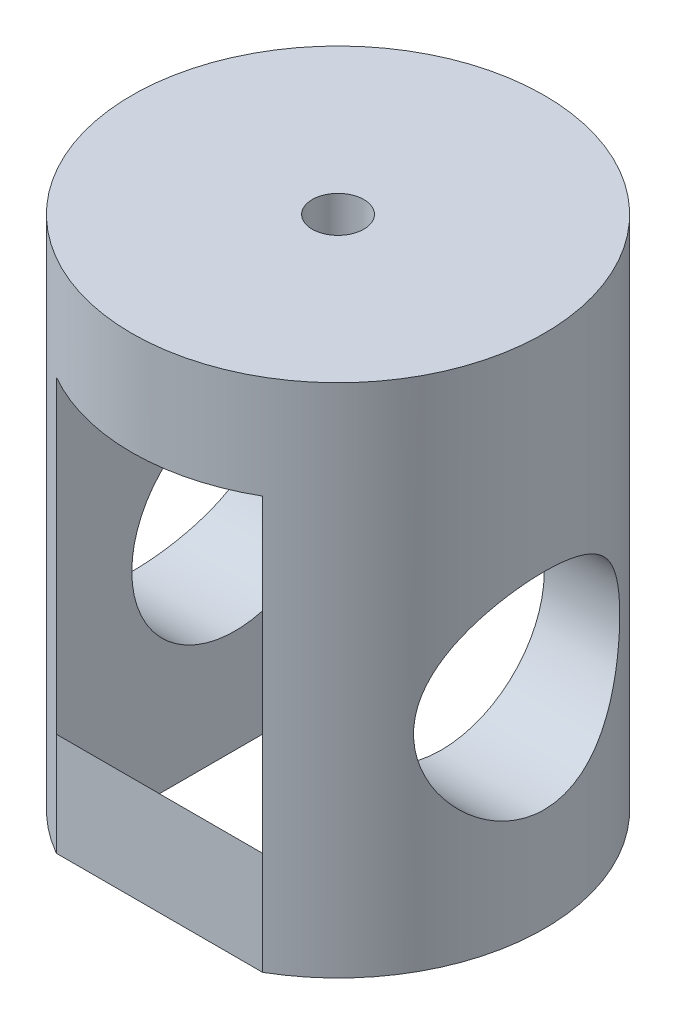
ISO-10303-21;
HEADER;
FILE_DESCRIPTION(('STEP AP214'),'2;1');
FILE_NAME('part.step','',(''),(''),'','','');
FILE_SCHEMA(('AUTOMOTIVE_DESIGN { 1 0 10303 214 1 1 1 1 }'));
ENDSEC;
DATA;
#1=APPLICATION_CONTEXT('core data for automotive mechanical design processes');
#2=APPLICATION_PROTOCOL_DEFINITION('international standard','automotive_design',2000,#1);
#3=PRODUCT_CONTEXT('',#1,'mechanical');
#4=PRODUCT('Part','Part','',(#3));
#5=PRODUCT_RELATED_PRODUCT_CATEGORY('part','',(#4));
#6=PRODUCT_DEFINITION_FORMATION('','',#4);
#7=PRODUCT_DEFINITION_CONTEXT('part definition',#1,'design');
#8=PRODUCT_DEFINITION('design','',#6,#7);
#9=PRODUCT_DEFINITION_SHAPE('','',#8);
#10=(LENGTH_UNIT() NAMED_UNIT(*) SI_UNIT(.MILLI.,.METRE.));
#11=(NAMED_UNIT(*) PLANE_ANGLE_UNIT() SI_UNIT($,.RADIAN.));
#12=(NAMED_UNIT(*) SI_UNIT($,.STERADIAN.) SOLID_ANGLE_UNIT());
#13=UNCERTAINTY_MEASURE_WITH_UNIT(LENGTH_MEASURE(1.E-05),#10,'distance_accuracy_value','');
#14=(GEOMETRIC_REPRESENTATION_CONTEXT(3) GLOBAL_UNCERTAINTY_ASSIGNED_CONTEXT((#13)) GLOBAL_UNIT_ASSIGNED_CONTEXT((#10,
#11,#12)) REPRESENTATION_CONTEXT('',''));
#15=CARTESIAN_POINT('',(0.,0.,0.));
#16=DIRECTION('',(0.,0.,1.));
#17=DIRECTION('',(1.,0.,0.));
#18=AXIS2_PLACEMENT_3D('',#15,#16,#17);
#19=CARTESIAN_POINT('',(-10.,40.,-17.3205080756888));
#20=DIRECTION('',(-1.,0.,0.));
#21=DIRECTION('',(0.,0.,1.));
#22=AXIS2_PLACEMENT_3D('',#19,#20,#21);
#23=PLANE('',#22);
#24=CARTESIAN_POINT('',(-9.99999999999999,20.,0.));
#25=DIRECTION('',(-1.,0.,0.));
#26=DIRECTION('',(0.,0.,1.));
#27=AXIS2_PLACEMENT_3D('',#24,#25,#26);
#28=CIRCLE('',#27,10.);
#29=CARTESIAN_POINT('',(-9.99999999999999,20.,10.));
#30=VERTEX_POINT('',#29);
#31=EDGE_CURVE('E127',#30,#30,#28,.F.);
#32=ORIENTED_EDGE('',*,*,#31,.F.);
#33=EDGE_LOOP('',(#32));
#34=FACE_BOUND('',#33,.T.);
#35=DIRECTION('',(0.,-1.,0.));
#36=VECTOR('',#35,1.);
#37=CARTESIAN_POINT('',(-10.,0.,10.3205080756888));
#38=LINE('',#37,#36);
#39=CARTESIAN_POINT('',(-10.,2.86853441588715,10.3205080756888));
#40=VERTEX_POINT('',#39);
#41=CARTESIAN_POINT('',(-10.,0.,10.3205080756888));
#42=VERTEX_POINT('',#41);
#43=EDGE_CURVE('E117',#40,#42,#38,.T.);
#44=ORIENTED_EDGE('',*,*,#43,.T.);
#45=DIRECTION('',(0.,0.,-1.));
#46=VECTOR('',#45,1.);
#47=CARTESIAN_POINT('',(-10.,0.,-17.3205080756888));
#48=LINE('',#47,#46);
#49=CARTESIAN_POINT('',(-10.,0.,-17.3205080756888));
#50=VERTEX_POINT('',#49);
#51=EDGE_CURVE('E105',#42,#50,#48,.T.);
#52=ORIENTED_EDGE('',*,*,#51,.T.);
#53=DIRECTION('',(0.,-1.,0.));
#54=VECTOR('',#53,1.);
#55=CARTESIAN_POINT('',(-10.,40.,-17.3205080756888));
#56=LINE('',#55,#54);
#57=CARTESIAN_POINT('',(-10.,40.,-17.3205080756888));
#58=VERTEX_POINT('',#57);
#59=EDGE_CURVE('E53',#58,#50,#56,.T.);
#60=ORIENTED_EDGE('',*,*,#59,.F.);
#61=DIRECTION('',(0.,0.,-1.));
#62=VECTOR('',#61,1.);
#63=CARTESIAN_POINT('',(-10.,40.,-17.3205080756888));
#64=LINE('',#63,#62);
#65=CARTESIAN_POINT('',(-10.,40.,17.3205080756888));
#66=VERTEX_POINT('',#65);
#67=EDGE_CURVE('E114',#66,#58,#64,.T.);
#68=ORIENTED_EDGE('',*,*,#67,.F.);
#69=DIRECTION('',(0.,-1.,0.));
#70=VECTOR('',#69,1.);
#71=CARTESIAN_POINT('',(-10.,40.,17.3205080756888));
#72=LINE('',#71,#70);
#73=CARTESIAN_POINT('',(-10.,10.,17.3205080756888));
#74=VERTEX_POINT('',#73);
#75=EDGE_CURVE('E11',#66,#74,#72,.T.);
#76=ORIENTED_EDGE('',*,*,#75,.T.);
#77=CARTESIAN_POINT('',(-10.,20.,0.));
#78=DIRECTION('',(1.,0.,0.));
#79=DIRECTION('',(0.,0.,1.));
#80=AXIS2_PLACEMENT_3D('',#77,#78,#79);
#81=CIRCLE('',#80,20.);
#82=EDGE_CURVE('E59',#74,#40,#81,.T.);
#83=ORIENTED_EDGE('',*,*,#82,.T.);
#84=EDGE_LOOP('',(#44,#52,#60,#68,#76,#83));
#85=FACE_BOUND('',#84,.T.);
#86=ADVANCED_FACE('F43',(#34,#85),#23,.F.);
#87=CARTESIAN_POINT('',(10.,40.,-17.3205080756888));
#88=DIRECTION('',(1.,0.,0.));
#89=DIRECTION('',(0.,0.,-1.));
#90=AXIS2_PLACEMENT_3D('',#87,#88,#89);
#91=PLANE('',#90);
#92=CARTESIAN_POINT('',(10.,20.,0.));
#93=DIRECTION('',(1.,0.,0.));
#94=DIRECTION('',(0.,0.,-1.));
#95=AXIS2_PLACEMENT_3D('',#92,#93,#94);
#96=CIRCLE('',#95,10.);
#97=CARTESIAN_POINT('',(10.,20.,-10.));
#98=VERTEX_POINT('',#97);
#99=EDGE_CURVE('E48',#98,#98,#96,.F.);
#100=ORIENTED_EDGE('',*,*,#99,.F.);
#101=EDGE_LOOP('',(#100));
#102=FACE_BOUND('',#101,.T.);
#103=DIRECTION('',(0.,-1.,0.));
#104=VECTOR('',#103,1.);
#105=CARTESIAN_POINT('',(10.,0.,10.3205080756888));
#106=LINE('',#105,#104);
#107=CARTESIAN_POINT('',(10.,2.86853441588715,10.3205080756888));
#108=VERTEX_POINT('',#107);
#109=CARTESIAN_POINT('',(10.,0.,10.3205080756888));
#110=VERTEX_POINT('',#109);
#111=EDGE_CURVE('E123',#108,#110,#106,.T.);
#112=ORIENTED_EDGE('',*,*,#111,.F.);
#113=CARTESIAN_POINT('',(10.,20.,0.));
#114=DIRECTION('',(1.,0.,0.));
#115=DIRECTION('',(0.,0.,1.));
#116=AXIS2_PLACEMENT_3D('',#113,#114,#115);
#117=CIRCLE('',#116,20.);
#118=CARTESIAN_POINT('',(10.,10.,17.3205080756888));
#119=VERTEX_POINT('',#118);
#120=EDGE_CURVE('E120',#119,#108,#117,.T.);
#121=ORIENTED_EDGE('',*,*,#120,.F.);
#122=DIRECTION('',(0.,-1.,0.));
#123=VECTOR('',#122,1.);
#124=CARTESIAN_POINT('',(10.,40.,17.3205080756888));
#125=LINE('',#124,#123);
#126=CARTESIAN_POINT('',(10.,40.,17.3205080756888));
#127=VERTEX_POINT('',#126);
#128=EDGE_CURVE('E197',#127,#119,#125,.T.);
#129=ORIENTED_EDGE('',*,*,#128,.F.);
#130=DIRECTION('',(0.,0.,1.));
#131=VECTOR('',#130,1.);
#132=CARTESIAN_POINT('',(10.,40.,-17.3205080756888));
#133=LINE('',#132,#131);
#134=CARTESIAN_POINT('',(10.,40.,-17.3205080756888));
#135=VERTEX_POINT('',#134);
#136=EDGE_CURVE('E194',#135,#127,#133,.T.);
#137=ORIENTED_EDGE('',*,*,#136,.F.);
#138=DIRECTION('',(0.,-1.,0.));
#139=VECTOR('',#138,1.);
#140=CARTESIAN_POINT('',(10.,40.,-17.3205080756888));
#141=LINE('',#140,#139);
#142=CARTESIAN_POINT('',(10.,0.,-17.3205080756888));
#143=VERTEX_POINT('',#142);
#144=EDGE_CURVE('E200',#135,#143,#141,.T.);
#145=ORIENTED_EDGE('',*,*,#144,.T.);
#146=DIRECTION('',(0.,0.,1.));
#147=VECTOR('',#146,1.);
#148=CARTESIAN_POINT('',(10.,0.,-17.3205080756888));
#149=LINE('',#148,#147);
#150=EDGE_CURVE('E190',#143,#110,#149,.T.);
#151=ORIENTED_EDGE('',*,*,#150,.T.);
#152=EDGE_LOOP('',(#112,#121,#129,#137,#145,#151));
#153=FACE_BOUND('',#152,.T.);
#154=ADVANCED_FACE('F156',(#102,#153),#91,.F.);
#155=CARTESIAN_POINT('',(0.,40.,0.));
#156=DIRECTION('',(0.,-1.,0.));
#157=DIRECTION('',(0.,0.,-1.));
#158=AXIS2_PLACEMENT_3D('',#155,#156,#157);
#159=CYLINDRICAL_SURFACE('',#158,20.);
#160=CARTESIAN_POINT('',(0.,0.,0.));
#161=DIRECTION('',(0.,1.,0.));
#162=DIRECTION('',(0.,0.,1.));
#163=AXIS2_PLACEMENT_3D('',#160,#161,#162);
#164=CIRCLE('',#163,20.);
#165=CARTESIAN_POINT('',(-10.,0.,17.3205080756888));
#166=VERTEX_POINT('',#165);
#167=EDGE_CURVE('E111',#50,#166,#164,.T.);
#168=ORIENTED_EDGE('',*,*,#167,.T.);
#169=DIRECTION('',(0.,1.,0.));
#170=VECTOR('',#169,1.);
#171=CARTESIAN_POINT('',(-10.,0.,17.3205080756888));
#172=LINE('',#171,#170);
#173=EDGE_CURVE('E67',#166,#74,#172,.T.);
#174=ORIENTED_EDGE('',*,*,#173,.T.);
#175=ORIENTED_EDGE('',*,*,#75,.F.);
#176=CARTESIAN_POINT('',(0.,40.,0.));
#177=DIRECTION('',(0.,1.,0.));
#178=DIRECTION('',(0.,0.,1.));
#179=AXIS2_PLACEMENT_3D('',#176,#177,#178);
#180=CIRCLE('',#179,20.);
#181=EDGE_CURVE('E213',#66,#127,#180,.T.);
#182=ORIENTED_EDGE('',*,*,#181,.T.);
#183=ORIENTED_EDGE('',*,*,#128,.T.);
#184=DIRECTION('',(0.,1.,0.));
#185=VECTOR('',#184,1.);
#186=CARTESIAN_POINT('',(10.,0.,17.3205080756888));
#187=LINE('',#186,#185);
#188=CARTESIAN_POINT('',(10.,0.,17.3205080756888));
#189=VERTEX_POINT('',#188);
#190=EDGE_CURVE('E229',#189,#119,#187,.T.);
#191=ORIENTED_EDGE('',*,*,#190,.F.);
#192=CARTESIAN_POINT('',(0.,0.,0.));
#193=DIRECTION('',(0.,1.,0.));
#194=DIRECTION('',(0.,0.,1.));
#195=AXIS2_PLACEMENT_3D('',#192,#193,#194);
#196=CIRCLE('',#195,20.);
#197=EDGE_CURVE('E188',#189,#143,#196,.T.);
#198=ORIENTED_EDGE('',*,*,#197,.T.);
#199=ORIENTED_EDGE('',*,*,#144,.F.);
#200=EDGE_CURVE('E207',#135,#58,#180,.T.);
#201=ORIENTED_EDGE('',*,*,#200,.T.);
#202=ORIENTED_EDGE('',*,*,#59,.T.);
#203=EDGE_LOOP('',(#168,#174,#175,#182,#183,#191,#198,#199,#201,#202));
#204=FACE_BOUND('',#203,.T.);
#205=CARTESIAN_POINT('',(0.,50.,0.));
#206=DIRECTION('',(0.,1.,0.));
#207=DIRECTION('',(0.,0.,1.));
#208=AXIS2_PLACEMENT_3D('',#205,#206,#207);
#209=CIRCLE('',#208,20.);
#210=CARTESIAN_POINT('',(0.,50.,20.));
#211=VERTEX_POINT('',#210);
#212=EDGE_CURVE('E210',#211,#211,#209,.T.);
#213=ORIENTED_EDGE('',*,*,#212,.F.);
#214=EDGE_LOOP('',(#213));
#215=FACE_BOUND('',#214,.T.);
#216=CARTESIAN_POINT('',(-17.3205080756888,20.,10.));
#217=CARTESIAN_POINT('',(-17.3205095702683,20.2606630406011,9.99999887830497));
#218=CARTESIAN_POINT('',(-17.3264124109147,20.5213487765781,9.98979463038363));
#219=CARTESIAN_POINT('',(-17.3498046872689,21.0407114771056,9.94911125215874));
#220=CARTESIAN_POINT('',(-17.3672995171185,21.2993874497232,9.91862268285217));
#221=CARTESIAN_POINT('',(-17.4132568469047,21.8130233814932,9.83771551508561));
#222=CARTESIAN_POINT('',(-17.4417365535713,22.0679768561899,9.78726564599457));
#223=CARTESIAN_POINT('',(-17.5086546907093,22.5720498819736,9.66704369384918));
#224=CARTESIAN_POINT('',(-17.5470974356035,22.821166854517,9.59726323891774));
#225=CARTESIAN_POINT('',(-17.6323996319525,23.310473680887,9.43962165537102));
#226=CARTESIAN_POINT('',(-17.6792090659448,23.5507068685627,9.3518675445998));
#227=CARTESIAN_POINT('',(-17.779982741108,24.0225542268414,9.15882440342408));
#228=CARTESIAN_POINT('',(-17.8339495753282,24.2541652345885,9.05352901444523));
#229=CARTESIAN_POINT('',(-17.9475017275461,24.7075453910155,8.82628481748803));
#230=CARTESIAN_POINT('',(-18.007085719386,24.9293168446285,8.70433993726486));
#231=CARTESIAN_POINT('',(-18.1303531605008,25.3621596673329,8.44458163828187));
#232=CARTESIAN_POINT('',(-18.1940367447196,25.5732306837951,8.30676769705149));
#233=CARTESIAN_POINT('',(-18.329363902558,26.0008375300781,8.0040071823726));
#234=CARTESIAN_POINT('',(-18.4012302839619,26.2163824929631,7.83775940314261));
#235=CARTESIAN_POINT('',(-18.5460965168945,26.6329349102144,7.48852658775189));
#236=CARTESIAN_POINT('',(-18.6190960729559,26.8339460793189,7.30554585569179));
#237=CARTESIAN_POINT('',(-18.7644955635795,27.2206945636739,6.92354675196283));
#238=CARTESIAN_POINT('',(-18.836894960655,27.4064192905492,6.72451542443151));
#239=CARTESIAN_POINT('',(-18.9792540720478,27.7613467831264,6.31154503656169));
#240=CARTESIAN_POINT('',(-19.0492146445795,27.9305553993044,6.09761130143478));
#241=CARTESIAN_POINT('',(-19.1896470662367,28.2623641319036,5.64077435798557));
#242=CARTESIAN_POINT('',(-19.2598322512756,28.4237392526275,5.39689043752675));
#243=CARTESIAN_POINT('',(-19.3935808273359,28.7252065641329,4.89454568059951));
#244=CARTESIAN_POINT('',(-19.4571438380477,28.8652975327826,4.63608400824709));
#245=CARTESIAN_POINT('',(-19.5757886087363,29.1227489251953,4.10635184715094));
#246=CARTESIAN_POINT('',(-19.6308744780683,29.240120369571,3.83508764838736));
#247=CARTESIAN_POINT('',(-19.7309453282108,29.4508629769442,3.28159286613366));
#248=CARTESIAN_POINT('',(-19.775931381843,29.5442366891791,2.99936345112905));
#249=CARTESIAN_POINT('',(-19.8516061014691,29.7000287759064,2.44661617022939));
#250=CARTESIAN_POINT('',(-19.8830841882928,29.7641767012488,2.17669338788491));
#251=CARTESIAN_POINT('',(-19.9352303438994,29.8699306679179,1.6314331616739));
#252=CARTESIAN_POINT('',(-19.9558988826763,29.9115376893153,1.35609595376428));
#253=CARTESIAN_POINT('',(-19.9858180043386,29.9716398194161,0.802434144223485));
#254=CARTESIAN_POINT('',(-19.9950744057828,29.9901467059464,0.52411113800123));
#255=CARTESIAN_POINT('',(-20.001913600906,30.003828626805,-0.0332441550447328));
#256=CARTESIAN_POINT('',(-19.9994971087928,29.9990050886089,-0.312276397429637));
#257=CARTESIAN_POINT('',(-19.9837839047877,29.9675360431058,-0.844365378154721));
#258=CARTESIAN_POINT('',(-19.9714530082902,29.9428274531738,-1.09756809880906));
#259=CARTESIAN_POINT('',(-19.9374335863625,29.8743173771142,-1.60072224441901));
#260=CARTESIAN_POINT('',(-19.9157457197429,29.8305172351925,-1.85067389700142));
#261=CARTESIAN_POINT('',(-19.8635314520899,29.724300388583,-2.34564683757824));
#262=CARTESIAN_POINT('',(-19.8330047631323,29.6618830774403,-2.59066796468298));
#263=CARTESIAN_POINT('',(-19.7638249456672,29.5190690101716,-3.0742307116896));
#264=CARTESIAN_POINT('',(-19.7251715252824,29.4386716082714,-3.31277209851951));
#265=CARTESIAN_POINT('',(-19.6400278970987,29.2594279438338,-3.78519130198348));
#266=CARTESIAN_POINT('',(-19.5934383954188,29.1603459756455,-4.01896179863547));
#267=CARTESIAN_POINT('',(-19.4938328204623,28.9453098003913,-4.47722728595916));
#268=CARTESIAN_POINT('',(-19.4408144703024,28.8293496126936,-4.70171895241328));
#269=CARTESIAN_POINT('',(-19.2738101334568,28.4574852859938,-5.35951935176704));
#270=CARTESIAN_POINT('',(-19.1518214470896,28.17748838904,-5.77743819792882));
#271=CARTESIAN_POINT('',(-18.8844067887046,27.5309599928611,-6.6018551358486));
#272=CARTESIAN_POINT('',(-18.7378553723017,27.1587504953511,-7.00353936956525));
#273=CARTESIAN_POINT('',(-18.5185765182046,26.5553615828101,-7.5565805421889));
#274=CARTESIAN_POINT('',(-18.4455210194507,26.3465480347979,-7.73279224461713));
#275=CARTESIAN_POINT('',(-18.301419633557,25.9146773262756,-8.06791510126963));
#276=CARTESIAN_POINT('',(-18.2303740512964,25.6916180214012,-8.22682364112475));
#277=CARTESIAN_POINT('',(-18.0878347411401,25.2176662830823,-8.5358678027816));
#278=CARTESIAN_POINT('',(-18.0166021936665,24.9659060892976,-8.68479491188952));
#279=CARTESIAN_POINT('',(-17.8810231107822,24.4489493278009,-8.96061518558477));
#280=CARTESIAN_POINT('',(-17.8166734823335,24.1837588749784,-9.08751826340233));
#281=CARTESIAN_POINT('',(-17.6972138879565,23.64159710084,-9.31801905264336));
#282=CARTESIAN_POINT('',(-17.6420984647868,23.3646328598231,-9.42163054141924));
#283=CARTESIAN_POINT('',(-17.5432965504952,22.8007562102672,-9.60435110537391));
#284=CARTESIAN_POINT('',(-17.4996085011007,22.5138451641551,-9.68346352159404));
#285=CARTESIAN_POINT('',(-17.4285246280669,21.9554952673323,-9.81078056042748));
#286=CARTESIAN_POINT('',(-17.400112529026,21.6846306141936,-9.86093677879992));
#287=CARTESIAN_POINT('',(-17.3557653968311,21.1386742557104,-9.93878416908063));
#288=CARTESIAN_POINT('',(-17.3398296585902,20.8635827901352,-9.96647661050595));
#289=CARTESIAN_POINT('',(-17.3211203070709,20.3117693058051,-9.99895720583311));
#290=CARTESIAN_POINT('',(-17.3183387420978,20.035048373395,-10.0037591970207));
#291=CARTESIAN_POINT('',(-17.3260388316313,19.4823571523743,-9.99041751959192));
#292=CARTESIAN_POINT('',(-17.3365195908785,19.2063868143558,-9.97227539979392));
#293=CARTESIAN_POINT('',(-17.3684286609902,18.6878300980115,-9.91658048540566));
#294=CARTESIAN_POINT('',(-17.3885290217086,18.4449043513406,-9.88137691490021));
#295=CARTESIAN_POINT('',(-17.4382137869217,17.9631581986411,-9.79342893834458));
#296=CARTESIAN_POINT('',(-17.467801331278,17.7243391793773,-9.74067872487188));
#297=CARTESIAN_POINT('',(-17.5355331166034,17.2523728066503,-9.61821012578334));
#298=CARTESIAN_POINT('',(-17.5736762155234,17.0192247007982,-9.54849400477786));
#299=CARTESIAN_POINT('',(-17.6574071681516,16.5597756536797,-9.39275103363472));
#300=CARTESIAN_POINT('',(-17.7029979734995,16.3334774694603,-9.30671771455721));
#301=CARTESIAN_POINT('',(-17.8535843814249,15.6461619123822,-9.01657018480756));
#302=CARTESIAN_POINT('',(-17.9691397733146,15.19832719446,-8.78600743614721));
#303=CARTESIAN_POINT('',(-18.2156365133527,14.3451898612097,-8.26280380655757));
#304=CARTESIAN_POINT('',(-18.3465857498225,13.93990925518,-7.97013103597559));
#305=CARTESIAN_POINT('',(-18.5540860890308,13.3445899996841,-7.46888401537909));
#306=CARTESIAN_POINT('',(-18.6294365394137,13.1378065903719,-7.27935116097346));
#307=CARTESIAN_POINT('',(-18.7793184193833,12.7407576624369,-6.88345408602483));
#308=CARTESIAN_POINT('',(-18.8538500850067,12.5504872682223,-6.67709486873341));
#309=CARTESIAN_POINT('',(-19.0002370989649,12.1874055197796,-6.24838707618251));
#310=CARTESIAN_POINT('',(-19.0720904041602,12.0146073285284,-6.02602665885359));
#311=CARTESIAN_POINT('',(-19.2111944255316,11.687849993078,-5.56664786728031));
#312=CARTESIAN_POINT('',(-19.2784470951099,11.533882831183,-5.32963579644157));
#313=CARTESIAN_POINT('',(-19.4083463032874,11.2420643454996,-4.83560208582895));
#314=CARTESIAN_POINT('',(-19.4708214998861,11.1047543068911,-4.57821478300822));
#315=CARTESIAN_POINT('',(-19.5873354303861,10.8525290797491,-4.05082787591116));
#316=CARTESIAN_POINT('',(-19.6413738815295,10.7376146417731,-3.78082784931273));
#317=CARTESIAN_POINT('',(-19.7393769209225,10.5315676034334,-3.23033940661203));
#318=CARTESIAN_POINT('',(-19.7833487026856,10.4404180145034,-2.94985864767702));
#319=CARTESIAN_POINT('',(-19.8599022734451,10.2829809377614,-2.38049331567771));
#320=CARTESIAN_POINT('',(-19.8924854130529,10.2166905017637,-2.09160974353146));
#321=CARTESIAN_POINT('',(-19.9427983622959,10.1148104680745,-1.53480500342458));
#322=CARTESIAN_POINT('',(-19.9616170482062,10.0769613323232,-1.26739371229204));
#323=CARTESIAN_POINT('',(-19.9884894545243,10.0230133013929,-0.72985199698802));
#324=CARTESIAN_POINT('',(-19.9965438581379,10.0069130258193,-0.459721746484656));
#325=CARTESIAN_POINT('',(-20.0016629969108,9.99667350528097,0.0809759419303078));
#326=CARTESIAN_POINT('',(-19.998731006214,10.0025277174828,0.351543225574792));
#327=CARTESIAN_POINT('',(-19.9819662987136,10.0361056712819,0.890971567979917));
#328=CARTESIAN_POINT('',(-19.9681338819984,10.0638288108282,1.15983267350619));
#329=CARTESIAN_POINT('',(-19.9312153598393,10.1382400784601,1.67605139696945));
#330=CARTESIAN_POINT('',(-19.9088004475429,10.18355535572,1.9236568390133));
#331=CARTESIAN_POINT('',(-19.8553300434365,10.292457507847,2.41384547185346));
#332=CARTESIAN_POINT('',(-19.8242750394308,10.3560433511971,2.65642894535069));
#333=CARTESIAN_POINT('',(-19.7542370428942,10.5008477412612,3.13506320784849));
#334=CARTESIAN_POINT('',(-19.7152547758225,10.5820646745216,3.3711145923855));
#335=CARTESIAN_POINT('',(-19.6302044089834,10.7614308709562,3.83546861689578));
#336=CARTESIAN_POINT('',(-19.5841335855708,10.8595866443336,4.06376823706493));
#337=CARTESIAN_POINT('',(-19.483810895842,11.0765183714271,4.52085803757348));
#338=CARTESIAN_POINT('',(-19.4292950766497,11.1959918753,4.74925902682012));
#339=CARTESIAN_POINT('',(-19.3148302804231,11.4515659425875,5.19522438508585));
#340=CARTESIAN_POINT('',(-19.2548794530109,11.587672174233,5.41278502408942));
#341=CARTESIAN_POINT('',(-19.1308402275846,11.875596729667,5.83606045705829));
#342=CARTESIAN_POINT('',(-19.0667510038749,12.0274181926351,6.04177287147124));
#343=CARTESIAN_POINT('',(-18.9358010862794,12.3458750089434,6.44045588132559));
#344=CARTESIAN_POINT('',(-18.8689402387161,12.5125111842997,6.63342576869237));
#345=CARTESIAN_POINT('',(-18.7271146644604,12.8770952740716,7.02443076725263));
#346=CARTESIAN_POINT('',(-18.6520069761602,13.0765084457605,7.22105023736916));
#347=CARTESIAN_POINT('',(-18.5021161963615,13.4911102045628,7.5968825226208));
#348=CARTESIAN_POINT('',(-18.4273330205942,13.7062943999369,7.77610015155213));
#349=CARTESIAN_POINT('',(-18.2800108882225,14.1516671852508,8.1163793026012));
#350=CARTESIAN_POINT('',(-18.2074742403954,14.3818705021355,8.27742256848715));
#351=CARTESIAN_POINT('',(-18.0668000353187,14.8560212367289,8.58012843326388));
#352=CARTESIAN_POINT('',(-17.9986630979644,15.0999705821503,8.72178830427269));
#353=CARTESIAN_POINT('',(-17.8668466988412,15.6083744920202,8.9888082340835));
#354=CARTESIAN_POINT('',(-17.8033795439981,15.8732353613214,9.11350193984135));
#355=CARTESIAN_POINT('',(-17.6857538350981,16.414528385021,9.3397203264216));
#356=CARTESIAN_POINT('',(-17.6315904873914,16.6909544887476,9.44125694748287));
#357=CARTESIAN_POINT('',(-17.5348420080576,17.2528111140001,9.61975104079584));
#358=CARTESIAN_POINT('',(-17.4922271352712,17.5382163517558,9.69677174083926));
#359=CARTESIAN_POINT('',(-17.420295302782,18.1161855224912,9.82541504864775));
#360=CARTESIAN_POINT('',(-17.3909690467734,18.4087442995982,9.87705541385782));
#361=CARTESIAN_POINT('',(-17.3529508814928,18.9179955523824,9.94364603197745));
#362=CARTESIAN_POINT('',(-17.340814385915,19.1336483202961,9.96475859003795));
#363=CARTESIAN_POINT('',(-17.3245920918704,19.5661954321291,9.99293651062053));
#364=CARTESIAN_POINT('',(-17.3205068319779,19.783089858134,10.0000009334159));
#365=CARTESIAN_POINT('',(-17.3205080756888,20.,10.));
#366=B_SPLINE_CURVE_WITH_KNOTS('',3,(#216,#217,#218,#219,#220,#221,#222,#223,#224,#225,#226,
#227,#228,#229,#230,#231,#232,#233,#234,#235,#236,#237,#238,#239,#240,#241,#242,#243,#244,#245,
#246,#247,#248,#249,#250,#251,#252,#253,#254,#255,#256,#257,#258,#259,#260,#261,#262,#263,#264,
#265,#266,#267,#268,#269,#270,#271,#272,#273,#274,#275,#276,#277,#278,#279,#280,#281,#282,#283,
#284,#285,#286,#287,#288,#289,#290,#291,#292,#293,#294,#295,#296,#297,#298,#299,#300,#301,#302,
#303,#304,#305,#306,#307,#308,#309,#310,#311,#312,#313,#314,#315,#316,#317,#318,#319,#320,#321,
#322,#323,#324,#325,#326,#327,#328,#329,#330,#331,#332,#333,#334,#335,#336,#337,#338,#339,#340,
#341,#342,#343,#344,#345,#346,#347,#348,#349,#350,#351,#352,#353,#354,#355,#356,#357,#358,#359,
#360,#361,#362,#363,#364,#365),.UNSPECIFIED.,.T.,.F.,(4,2,2,2,2,2,2,2,2,2,2,2,2,2,2,2,2,2,2,2,2,
2,2,2,2,2,2,2,2,2,2,2,2,2,2,2,2,2,2,2,2,2,2,2,2,2,2,2,2,2,2,2,2,2,2,2,2,2,2,2,2,2,2,2,2,2,2,2,2,
2,2,2,2,2,4),(0.,0.781764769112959,1.56389357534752,2.34725251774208,3.13095125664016,
3.91011273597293,4.689557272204,5.46881824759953,6.24810488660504,7.09181817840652,
7.93531505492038,8.77949974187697,9.62338430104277,10.5244589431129,11.4255853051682,
12.3262734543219,13.2268658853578,14.063393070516,14.8998838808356,15.735948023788,
16.571961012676,17.3351709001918,18.0983270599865,18.8615080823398,19.6247165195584,
20.3982891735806,21.1721366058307,22.7189130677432,24.411902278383,25.2596540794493,
26.1075337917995,27.0095657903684,27.9111907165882,28.8122809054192,29.7132481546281,
30.542861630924,31.3724282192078,32.2014932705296,33.0305023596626,33.7685142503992,
34.5067706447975,35.244928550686,35.9833797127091,37.5272041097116,39.0718230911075,
39.9423348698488,40.8125887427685,41.6834934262,42.5540260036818,43.4478458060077,
44.3416955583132,45.2349045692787,46.1280076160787,46.9391312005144,47.7502033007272,
48.5610337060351,49.371841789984,50.1291222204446,50.8863599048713,51.6435283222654,
52.4009883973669,53.190547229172,53.980375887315,54.7703626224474,55.5603932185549,
56.4292490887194,57.2978639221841,58.1673436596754,59.0369456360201,59.934364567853,
60.8313197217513,61.7259424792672,62.6199384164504,63.27043863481,63.9209823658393),.UNSPECIFIED.);
#367=CARTESIAN_POINT('',(-17.3205080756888,20.,10.));
#368=VERTEX_POINT('',#367);
#369=EDGE_CURVE('E135',#368,#368,#366,.T.);
#370=ORIENTED_EDGE('',*,*,#369,.F.);
#371=EDGE_LOOP('',(#370));
#372=FACE_BOUND('',#371,.T.);
#373=CARTESIAN_POINT('',(20.,10.,0.));
#374=CARTESIAN_POINT('',(19.9999992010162,10.0000008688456,-0.26297774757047));
#375=CARTESIAN_POINT('',(19.9948010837,10.0103855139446,-0.525973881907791));
#376=CARTESIAN_POINT('',(19.9741395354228,10.0518058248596,-1.05002923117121));
#377=CARTESIAN_POINT('',(19.9586716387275,10.0828504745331,-1.31108755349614));
#378=CARTESIAN_POINT('',(19.9178362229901,10.1652919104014,-1.82963226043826));
#379=CARTESIAN_POINT('',(19.8924520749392,10.2167228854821,-2.08711188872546));
#380=CARTESIAN_POINT('',(19.8324363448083,10.3393382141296,-2.59618182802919));
#381=CARTESIAN_POINT('',(19.7978056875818,10.4105205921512,-2.84777272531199));
#382=CARTESIAN_POINT('',(19.720303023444,10.5715690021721,-3.34246836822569));
#383=CARTESIAN_POINT('',(19.6774637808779,10.6613608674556,-3.58560245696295));
#384=CARTESIAN_POINT('',(19.5844658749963,10.8589443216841,-4.06298432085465));
#385=CARTESIAN_POINT('',(19.5343070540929,10.9667362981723,-4.29723190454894));
#386=CARTESIAN_POINT('',(19.4278257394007,11.1993692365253,-4.75551398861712));
#387=CARTESIAN_POINT('',(19.371505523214,11.3242039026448,-4.97955221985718));
#388=CARTESIAN_POINT('',(19.2538936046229,11.5900869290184,-5.41653080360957));
#389=CARTESIAN_POINT('',(19.1925999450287,11.7311416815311,-5.62946673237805));
#390=CARTESIAN_POINT('',(19.0625536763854,12.0375045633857,-6.05571153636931));
#391=CARTESIAN_POINT('',(18.9935741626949,12.2037622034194,-6.2682689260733));
#392=CARTESIAN_POINT('',(18.8531326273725,12.5524451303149,-6.67880739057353));
#393=CARTESIAN_POINT('',(18.7816704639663,12.734871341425,-6.87678763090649));
#394=CARTESIAN_POINT('',(18.6379106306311,13.1150385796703,-7.25738906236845));
#395=CARTESIAN_POINT('',(18.5656124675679,13.3127890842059,-7.44000060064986));
#396=CARTESIAN_POINT('',(18.4219676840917,13.7226019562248,-7.78888361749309));
#397=CARTESIAN_POINT('',(18.3506212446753,13.9346670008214,-7.95515202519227));
#398=CARTESIAN_POINT('',(18.2052535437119,14.3891931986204,-8.2827111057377));
#399=CARTESIAN_POINT('',(18.1314567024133,14.6327353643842,-8.44260565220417));
#400=CARTESIAN_POINT('',(17.9894590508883,15.1339584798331,-8.74109142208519));
#401=CARTESIAN_POINT('',(17.9212558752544,15.3916333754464,-8.87969167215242));
#402=CARTESIAN_POINT('',(17.7927881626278,15.9196992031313,-9.13438777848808));
#403=CARTESIAN_POINT('',(17.7325212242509,16.1900862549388,-9.25049044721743));
#404=CARTESIAN_POINT('',(17.6222099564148,16.74188595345,-9.45894522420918));
#405=CARTESIAN_POINT('',(17.5721644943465,17.0232973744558,-9.55129996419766));
#406=CARTESIAN_POINT('',(17.4870229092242,17.5779150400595,-9.70625458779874));
#407=CARTESIAN_POINT('',(17.4512120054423,17.85060625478,-9.77030307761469));
#408=CARTESIAN_POINT('',(17.3919377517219,18.4017164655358,-9.87543221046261));
#409=CARTESIAN_POINT('',(17.368473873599,18.6801352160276,-9.91651383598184));
#410=CARTESIAN_POINT('',(17.3349233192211,19.2400145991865,-9.97504777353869));
#411=CARTESIAN_POINT('',(17.3248253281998,19.521472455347,-9.99252007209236));
#412=CARTESIAN_POINT('',(17.3184259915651,20.0850025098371,-10.0036080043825));
#413=CARTESIAN_POINT('',(17.3221233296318,20.3670746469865,-9.99722591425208));
#414=CARTESIAN_POINT('',(17.3418743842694,20.8954047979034,-9.96291632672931));
#415=CARTESIAN_POINT('',(17.3563927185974,21.1419001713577,-9.93766509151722));
#416=CARTESIAN_POINT('',(17.3954780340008,21.6316392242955,-9.8690882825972));
#417=CARTESIAN_POINT('',(17.4200483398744,21.8748818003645,-9.82575672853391));
#418=CARTESIAN_POINT('',(17.4784283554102,22.3563917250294,-9.72152759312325));
#419=CARTESIAN_POINT('',(17.5122368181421,22.5946597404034,-9.66063238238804));
#420=CARTESIAN_POINT('',(17.5880654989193,23.0649535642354,-9.52187989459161));
#421=CARTESIAN_POINT('',(17.6300889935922,23.2969768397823,-9.44401584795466));
#422=CARTESIAN_POINT('',(17.7221768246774,23.7587105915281,-9.27007793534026));
#423=CARTESIAN_POINT('',(17.7724029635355,23.9882470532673,-9.17362860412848));
#424=CARTESIAN_POINT('',(17.878810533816,24.4384381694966,-8.96447979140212));
#425=CARTESIAN_POINT('',(17.9349939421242,24.6590898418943,-8.85177491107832));
#426=CARTESIAN_POINT('',(18.0518884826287,25.090561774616,-8.61087933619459));
#427=CARTESIAN_POINT('',(18.1126004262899,25.3013802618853,-8.4826858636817));
#428=CARTESIAN_POINT('',(18.2371218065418,25.7123523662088,-8.21155546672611));
#429=CARTESIAN_POINT('',(18.3009314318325,25.9125053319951,-8.06861764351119));
#430=CARTESIAN_POINT('',(18.4384710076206,26.3261316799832,-7.74962298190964));
#431=CARTESIAN_POINT('',(18.5124312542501,26.538066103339,-7.57166567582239));
#432=CARTESIAN_POINT('',(18.6605447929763,26.9463748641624,-7.19890817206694));
#433=CARTESIAN_POINT('',(18.7346980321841,27.1427530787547,-7.00411219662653));
#434=CARTESIAN_POINT('',(18.8814062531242,27.5191465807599,-6.5984132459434));
#435=CARTESIAN_POINT('',(18.9539598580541,27.6991481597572,-6.38749704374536));
#436=CARTESIAN_POINT('',(19.0955673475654,28.0414528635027,-5.9507961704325));
#437=CARTESIAN_POINT('',(19.164622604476,28.2037629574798,-5.72501741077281));
#438=CARTESIAN_POINT('',(19.3006480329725,28.5167958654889,-5.24872768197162));
#439=CARTESIAN_POINT('',(19.3673693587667,28.6666208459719,-4.99755374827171));
#440=CARTESIAN_POINT('',(19.4932401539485,28.9443692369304,-4.48152997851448));
#441=CARTESIAN_POINT('',(19.5523892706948,29.072291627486,-4.21667950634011));
#442=CARTESIAN_POINT('',(19.6613492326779,29.3047943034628,-3.67526022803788));
#443=CARTESIAN_POINT('',(19.7111660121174,29.4093894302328,-3.39869900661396));
#444=CARTESIAN_POINT('',(19.7999810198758,29.5940507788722,-2.83582264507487));
#445=CARTESIAN_POINT('',(19.8389804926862,29.6741198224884,-2.54950863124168));
#446=CARTESIAN_POINT('',(19.9021913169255,29.8030658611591,-1.99360082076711));
#447=CARTESIAN_POINT('',(19.9273600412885,29.8539772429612,-1.72458658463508));
#448=CARTESIAN_POINT('',(19.9668602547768,29.9336151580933,-1.18250594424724));
#449=CARTESIAN_POINT('',(19.9811923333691,29.96234289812,-0.909439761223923));
#450=CARTESIAN_POINT('',(19.9986076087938,29.9972263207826,-0.361621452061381));
#451=CARTESIAN_POINT('',(20.0016953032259,30.0033910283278,-0.0868700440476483));
#452=CARTESIAN_POINT('',(19.996544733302,29.9930888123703,0.462095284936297));
#453=CARTESIAN_POINT('',(19.9883069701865,29.9766228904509,0.736309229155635));
#454=CARTESIAN_POINT('',(19.9618171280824,29.9234379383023,1.26069578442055));
#455=CARTESIAN_POINT('',(19.9443921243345,29.8883904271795,1.51108216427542));
#456=CARTESIAN_POINT('',(19.9005341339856,29.7996300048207,2.00770334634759));
#457=CARTESIAN_POINT('',(19.8741017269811,29.7459182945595,2.25393841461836));
#458=CARTESIAN_POINT('',(19.812845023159,29.6203860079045,2.7406844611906));
#459=CARTESIAN_POINT('',(19.7780202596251,29.5485644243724,2.98119512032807));
#460=CARTESIAN_POINT('',(19.7007681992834,29.3875053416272,3.4550508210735));
#461=CARTESIAN_POINT('',(19.6583405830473,29.2982671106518,3.68839556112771));
#462=CARTESIAN_POINT('',(19.5655046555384,29.1003752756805,4.15316088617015));
#463=CARTESIAN_POINT('',(19.5149041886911,28.991242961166,4.38433936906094));
#464=CARTESIAN_POINT('',(19.4077573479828,28.7562521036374,4.83663774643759));
#465=CARTESIAN_POINT('',(19.3512088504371,28.6303875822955,5.05775400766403));
#466=CARTESIAN_POINT('',(19.1744474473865,28.2290565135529,5.70436813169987));
#467=CARTESIAN_POINT('',(19.0470672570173,27.929746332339,6.11337858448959));
#468=CARTESIAN_POINT('',(18.7707873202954,27.2422994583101,6.91779518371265));
#469=CARTESIAN_POINT('',(18.6210027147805,26.8483262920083,7.30792110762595));
#470=CARTESIAN_POINT('',(18.3999640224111,26.2127394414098,7.84082560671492));
#471=CARTESIAN_POINT('',(18.3268393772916,25.9932647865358,8.00984942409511));
#472=CARTESIAN_POINT('',(18.183737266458,25.5402605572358,8.32960568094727));
#473=CARTESIAN_POINT('',(18.1137602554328,25.3067289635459,8.4803354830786));
#474=CARTESIAN_POINT('',(17.9757225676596,24.8150740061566,8.76928163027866));
#475=CARTESIAN_POINT('',(17.9079221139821,24.5563066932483,8.90652817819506));
#476=CARTESIAN_POINT('',(17.7804404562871,24.0261884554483,9.15837639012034));
#477=CARTESIAN_POINT('',(17.7207553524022,23.7548436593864,9.27298894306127));
#478=CARTESIAN_POINT('',(17.6118078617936,23.2014501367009,9.47827705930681));
#479=CARTESIAN_POINT('',(17.5625371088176,22.9194102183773,9.568971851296));
#480=CARTESIAN_POINT('',(17.4764560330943,22.3466167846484,9.72530086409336));
#481=CARTESIAN_POINT('',(17.4396437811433,22.0558646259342,9.79093896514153));
#482=CARTESIAN_POINT('',(17.3830260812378,21.4964752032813,9.89107565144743));
#483=CARTESIAN_POINT('',(17.3619273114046,21.2283942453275,9.92795857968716));
#484=CARTESIAN_POINT('',(17.332136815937,20.6894393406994,9.97987692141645));
#485=CARTESIAN_POINT('',(17.3234442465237,20.4185655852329,9.99491382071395));
#486=CARTESIAN_POINT('',(17.3188284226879,19.8764864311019,10.0029096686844));
#487=CARTESIAN_POINT('',(17.3229004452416,19.60528119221,9.9958767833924));
#488=CARTESIAN_POINT('',(17.3436339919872,19.0648278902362,9.95985898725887));
#489=CARTESIAN_POINT('',(17.3602950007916,18.7955797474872,9.93087497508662));
#490=CARTESIAN_POINT('',(17.4033551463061,18.2868855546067,9.85519722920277));
#491=CARTESIAN_POINT('',(17.4286705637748,18.047051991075,9.81046230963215));
#492=CARTESIAN_POINT('',(17.4882355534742,17.5722708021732,9.70388285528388));
#493=CARTESIAN_POINT('',(17.5224880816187,17.3373248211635,9.6420326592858));
#494=CARTESIAN_POINT('',(17.5988921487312,16.873776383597,9.50186064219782));
#495=CARTESIAN_POINT('',(17.6410423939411,16.6451728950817,9.42354151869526));
#496=CARTESIAN_POINT('',(17.7320944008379,16.1953015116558,9.25107208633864));
#497=CARTESIAN_POINT('',(17.7809991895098,15.9740369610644,9.15691467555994));
#498=CARTESIAN_POINT('',(17.8877520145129,15.5253741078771,8.94668289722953));
#499=CARTESIAN_POINT('',(17.9459794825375,15.2985558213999,8.82956366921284));
#500=CARTESIAN_POINT('',(18.067122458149,14.855454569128,8.57895403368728));
#501=CARTESIAN_POINT('',(18.130038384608,14.6391725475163,8.44546216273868));
#502=CARTESIAN_POINT('',(18.2590224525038,14.2179486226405,8.16285657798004));
#503=CARTESIAN_POINT('',(18.3250916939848,14.0130107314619,8.01373739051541));
#504=CARTESIAN_POINT('',(18.4588439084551,13.6153314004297,7.70065351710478));
#505=CARTESIAN_POINT('',(18.5265271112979,13.4225917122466,7.53668670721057));
#506=CARTESIAN_POINT('',(18.6702735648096,13.0274109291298,7.17380336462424));
#507=CARTESIAN_POINT('',(18.746353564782,12.8266468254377,6.97306234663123));
#508=CARTESIAN_POINT('',(18.8966226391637,12.442648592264,6.55492133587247));
#509=CARTESIAN_POINT('',(18.9708122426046,12.2594095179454,6.33752607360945));
#510=CARTESIAN_POINT('',(19.1154396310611,11.9114217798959,5.88693376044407));
#511=CARTESIAN_POINT('',(19.1858744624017,11.7466875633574,5.65372458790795));
#512=CARTESIAN_POINT('',(19.3210638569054,11.4371208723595,5.1728954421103));
#513=CARTESIAN_POINT('',(19.3858187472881,11.29228725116,4.92527630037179));
#514=CARTESIAN_POINT('',(19.5083417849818,11.0228117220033,4.41518835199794));
#515=CARTESIAN_POINT('',(19.5660555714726,10.898324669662,4.15262447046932));
#516=CARTESIAN_POINT('',(19.6722841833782,10.6721526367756,3.61607511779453));
#517=CARTESIAN_POINT('',(19.7208001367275,10.5704648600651,3.34209105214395));
#518=CARTESIAN_POINT('',(19.8070877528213,10.3913125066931,2.78539452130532));
#519=CARTESIAN_POINT('',(19.8448847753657,10.3137907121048,2.50270444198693));
#520=CARTESIAN_POINT('',(19.908692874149,10.1837239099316,1.93047321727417));
#521=CARTESIAN_POINT('',(19.9347111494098,10.1311636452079,1.64093637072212));
#522=CARTESIAN_POINT('',(19.9695276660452,10.0610510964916,1.12608352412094));
#523=CARTESIAN_POINT('',(19.9809348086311,10.038176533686,0.901651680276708));
#524=CARTESIAN_POINT('',(19.9961714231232,10.0076504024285,0.451484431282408));
#525=CARTESIAN_POINT('',(20.0000006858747,9.99999925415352,0.225748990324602));
#526=CARTESIAN_POINT('',(20.,10.,0.));
#527=B_SPLINE_CURVE_WITH_KNOTS('',3,(#373,#374,#375,#376,#377,#378,#379,#380,#381,#382,#383,
#384,#385,#386,#387,#388,#389,#390,#391,#392,#393,#394,#395,#396,#397,#398,#399,#400,#401,#402,
#403,#404,#405,#406,#407,#408,#409,#410,#411,#412,#413,#414,#415,#416,#417,#418,#419,#420,#421,
#422,#423,#424,#425,#426,#427,#428,#429,#430,#431,#432,#433,#434,#435,#436,#437,#438,#439,#440,
#441,#442,#443,#444,#445,#446,#447,#448,#449,#450,#451,#452,#453,#454,#455,#456,#457,#458,#459,
#460,#461,#462,#463,#464,#465,#466,#467,#468,#469,#470,#471,#472,#473,#474,#475,#476,#477,#478,
#479,#480,#481,#482,#483,#484,#485,#486,#487,#488,#489,#490,#491,#492,#493,#494,#495,#496,#497,
#498,#499,#500,#501,#502,#503,#504,#505,#506,#507,#508,#509,#510,#511,#512,#513,#514,#515,#516,
#517,#518,#519,#520,#521,#522,#523,#524,#525,#526),.UNSPECIFIED.,.T.,.F.,(4,2,2,2,2,2,2,2,2,2,2,
2,2,2,2,2,2,2,2,2,2,2,2,2,2,2,2,2,2,2,2,2,2,2,2,2,2,2,2,2,2,2,2,2,2,2,2,2,2,2,2,2,2,2,2,2,2,2,2,
2,2,2,2,2,2,2,2,2,2,2,2,2,2,2,2,2,4),(0.,0.788710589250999,1.57776436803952,2.36814706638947,
3.15845073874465,3.94566328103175,4.73289277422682,5.51983223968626,6.30708290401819,
7.14179607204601,7.9765569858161,8.81183834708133,9.64727635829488,10.5477781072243,
11.447897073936,12.3477430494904,13.2474892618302,14.0934532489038,14.9393810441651,
15.7845922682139,16.6297228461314,17.3734776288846,18.1174786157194,18.8613792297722,
19.6055771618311,20.3667813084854,21.1282388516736,21.889833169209,22.6514739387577,
23.509891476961,24.3680943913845,25.2270091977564,26.0855844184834,26.9843425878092,
27.8831425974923,28.781369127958,29.6794922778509,30.5032194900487,31.3269018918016,
32.1502547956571,32.9735712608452,33.7329722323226,34.4923243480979,35.2517187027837,
36.0111449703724,36.7921013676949,37.5733375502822,39.1349970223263,40.8500130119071,
41.7087612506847,42.5676331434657,43.4684238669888,44.3687801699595,45.2684104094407,
46.1679012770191,46.9810473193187,47.7941380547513,48.6069279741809,49.4196846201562,
50.1547113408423,50.889981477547,51.6251312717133,52.3606115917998,53.1452977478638,
53.9300540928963,54.7150862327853,55.5002308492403,56.3809909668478,57.2615018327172,
58.1426954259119,59.0238382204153,59.9114030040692,60.798858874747,61.6841972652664,
62.5689938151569,63.2460309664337,63.9230868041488),.UNSPECIFIED.);
#528=CARTESIAN_POINT('',(20.,10.,0.));
#529=VERTEX_POINT('',#528);
#530=EDGE_CURVE('E142',#529,#529,#527,.T.);
#531=ORIENTED_EDGE('',*,*,#530,.F.);
#532=EDGE_LOOP('',(#531));
#533=FACE_BOUND('',#532,.T.);
#534=ADVANCED_FACE('F45',(#204,#215,#372,#533),#159,.T.);
#535=CARTESIAN_POINT('',(0.,40.,0.));
#536=DIRECTION('',(0.,1.,0.));
#537=DIRECTION('',(0.,0.,1.));
#538=AXIS2_PLACEMENT_3D('',#535,#536,#537);
#539=PLANE('',#538);
#540=CARTESIAN_POINT('',(0.,40.,0.));
#541=DIRECTION('',(0.,1.,0.));
#542=DIRECTION('',(0.,0.,1.));
#543=AXIS2_PLACEMENT_3D('',#540,#541,#542);
#544=CIRCLE('',#543,2.5);
#545=CARTESIAN_POINT('',(0.,40.,2.5));
#546=VERTEX_POINT('',#545);
#547=EDGE_CURVE('E203',#546,#546,#544,.T.);
#548=ORIENTED_EDGE('',*,*,#547,.T.);
#549=EDGE_LOOP('',(#548));
#550=FACE_BOUND('',#549,.T.);
#551=ORIENTED_EDGE('',*,*,#136,.T.);
#552=ORIENTED_EDGE('',*,*,#181,.F.);
#553=ORIENTED_EDGE('',*,*,#67,.T.);
#554=ORIENTED_EDGE('',*,*,#200,.F.);
#555=EDGE_LOOP('',(#551,#552,#553,#554));
#556=FACE_BOUND('',#555,.T.);
#557=ADVANCED_FACE('F168',(#550,#556),#539,.F.);
#558=CARTESIAN_POINT('',(0.,0.,0.));
#559=DIRECTION('',(0.,1.,0.));
#560=DIRECTION('',(0.,0.,1.));
#561=AXIS2_PLACEMENT_3D('',#558,#559,#560);
#562=PLANE('',#561);
#563=ORIENTED_EDGE('',*,*,#167,.F.);
#564=ORIENTED_EDGE('',*,*,#51,.F.);
#565=DIRECTION('',(1.,0.,0.));
#566=VECTOR('',#565,1.);
#567=CARTESIAN_POINT('',(-10.,0.,10.3205080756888));
#568=LINE('',#567,#566);
#569=EDGE_CURVE('E108',#42,#110,#568,.T.);
#570=ORIENTED_EDGE('',*,*,#569,.T.);
#571=ORIENTED_EDGE('',*,*,#150,.F.);
#572=ORIENTED_EDGE('',*,*,#197,.F.);
#573=DIRECTION('',(1.,0.,0.));
#574=VECTOR('',#573,1.);
#575=CARTESIAN_POINT('',(-10.,0.,17.3205080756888));
#576=LINE('',#575,#574);
#577=EDGE_CURVE('E124',#166,#189,#576,.T.);
#578=ORIENTED_EDGE('',*,*,#577,.F.);
#579=EDGE_LOOP('',(#563,#564,#570,#571,#572,#578));
#580=FACE_BOUND('',#579,.T.);
#581=ADVANCED_FACE('F106',(#580),#562,.F.);
#582=CARTESIAN_POINT('',(0.,50.,0.));
#583=DIRECTION('',(0.,1.,0.));
#584=DIRECTION('',(0.,0.,1.));
#585=AXIS2_PLACEMENT_3D('',#582,#583,#584);
#586=PLANE('',#585);
#587=ORIENTED_EDGE('',*,*,#212,.T.);
#588=EDGE_LOOP('',(#587));
#589=FACE_BOUND('',#588,.T.);
#590=CARTESIAN_POINT('',(0.,50.,0.));
#591=DIRECTION('',(0.,1.,0.));
#592=DIRECTION('',(0.,0.,1.));
#593=AXIS2_PLACEMENT_3D('',#590,#591,#592);
#594=CIRCLE('',#593,2.5);
#595=CARTESIAN_POINT('',(0.,50.,2.5));
#596=VERTEX_POINT('',#595);
#597=EDGE_CURVE('E204',#596,#596,#594,.T.);
#598=ORIENTED_EDGE('',*,*,#597,.F.);
#599=EDGE_LOOP('',(#598));
#600=FACE_BOUND('',#599,.T.);
#601=ADVANCED_FACE('F163',(#589,#600),#586,.T.);
#602=CARTESIAN_POINT('',(0.,50.,0.));
#603=DIRECTION('',(0.,-1.,0.));
#604=DIRECTION('',(0.,0.,-1.));
#605=AXIS2_PLACEMENT_3D('',#602,#603,#604);
#606=CYLINDRICAL_SURFACE('',#605,2.5);
#607=ORIENTED_EDGE('',*,*,#597,.T.);
#608=EDGE_LOOP('',(#607));
#609=FACE_BOUND('',#608,.T.);
#610=ORIENTED_EDGE('',*,*,#547,.F.);
#611=EDGE_LOOP('',(#610));
#612=FACE_BOUND('',#611,.T.);
#613=ADVANCED_FACE('F153',(#609,#612),#606,.F.);
#614=CARTESIAN_POINT('',(20.,20.,0.));
#615=DIRECTION('',(-1.,0.,0.));
#616=DIRECTION('',(0.,0.,1.));
#617=AXIS2_PLACEMENT_3D('',#614,#615,#616);
#618=CYLINDRICAL_SURFACE('',#617,10.);
#619=ORIENTED_EDGE('',*,*,#99,.T.);
#620=EDGE_LOOP('',(#619));
#621=FACE_BOUND('',#620,.T.);
#622=ORIENTED_EDGE('',*,*,#530,.T.);
#623=EDGE_LOOP('',(#622));
#624=FACE_BOUND('',#623,.T.);
#625=ADVANCED_FACE('F147',(#621,#624),#618,.F.);
#626=ORIENTED_EDGE('',*,*,#31,.T.);
#627=EDGE_LOOP('',(#626));
#628=FACE_BOUND('',#627,.T.);
#629=ORIENTED_EDGE('',*,*,#369,.T.);
#630=EDGE_LOOP('',(#629));
#631=FACE_BOUND('',#630,.T.);
#632=ADVANCED_FACE('F152',(#628,#631),#618,.F.);
#633=CARTESIAN_POINT('',(-10.,0.,10.3205080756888));
#634=DIRECTION('',(0.,0.,1.));
#635=DIRECTION('',(1.,0.,0.));
#636=AXIS2_PLACEMENT_3D('',#633,#634,#635);
#637=PLANE('',#636);
#638=ORIENTED_EDGE('',*,*,#111,.T.);
#639=ORIENTED_EDGE('',*,*,#569,.F.);
#640=ORIENTED_EDGE('',*,*,#43,.F.);
#641=DIRECTION('',(1.,0.,0.));
#642=VECTOR('',#641,1.);
#643=CARTESIAN_POINT('',(-10.,2.86853441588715,10.3205080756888));
#644=LINE('',#643,#642);
#645=EDGE_CURVE('E234',#40,#108,#644,.T.);
#646=ORIENTED_EDGE('',*,*,#645,.T.);
#647=EDGE_LOOP('',(#638,#639,#640,#646));
#648=FACE_BOUND('',#647,.T.);
#649=ADVANCED_FACE('F122',(#648),#637,.F.);
#650=CARTESIAN_POINT('',(-10.,0.,17.3205080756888));
#651=DIRECTION('',(0.,0.,-1.));
#652=DIRECTION('',(-1.,0.,0.));
#653=AXIS2_PLACEMENT_3D('',#650,#651,#652);
#654=PLANE('',#653);
#655=ORIENTED_EDGE('',*,*,#190,.T.);
#656=DIRECTION('',(1.,0.,0.));
#657=VECTOR('',#656,1.);
#658=CARTESIAN_POINT('',(-10.,10.,17.3205080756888));
#659=LINE('',#658,#657);
#660=EDGE_CURVE('E129',#74,#119,#659,.T.);
#661=ORIENTED_EDGE('',*,*,#660,.F.);
#662=ORIENTED_EDGE('',*,*,#173,.F.);
#663=ORIENTED_EDGE('',*,*,#577,.T.);
#664=EDGE_LOOP('',(#655,#661,#662,#663));
#665=FACE_BOUND('',#664,.T.);
#666=ADVANCED_FACE('F238',(#665),#654,.F.);
#667=CARTESIAN_POINT('',(-10.,20.,0.));
#668=DIRECTION('',(1.,0.,0.));
#669=DIRECTION('',(0.,0.,-1.));
#670=AXIS2_PLACEMENT_3D('',#667,#668,#669);
#671=CYLINDRICAL_SURFACE('',#670,20.);
#672=ORIENTED_EDGE('',*,*,#120,.T.);
#673=ORIENTED_EDGE('',*,*,#645,.F.);
#674=ORIENTED_EDGE('',*,*,#82,.F.);
#675=ORIENTED_EDGE('',*,*,#660,.T.);
#676=EDGE_LOOP('',(#672,#673,#674,#675));
#677=FACE_BOUND('',#676,.T.);
#678=ADVANCED_FACE('F236',(#677),#671,.F.);
#679=CLOSED_SHELL('',(#86,#154,#534,#557,#581,#601,#613,#625,#632,#649,#666,#678));
#680=MANIFOLD_SOLID_BREP('B2',#679);
#681=ADVANCED_BREP_SHAPE_REPRESENTATION('',(#18,#680),#14);
#682=SHAPE_DEFINITION_REPRESENTATION(#9,#681);
ENDSEC;
END-ISO-10303-21;
